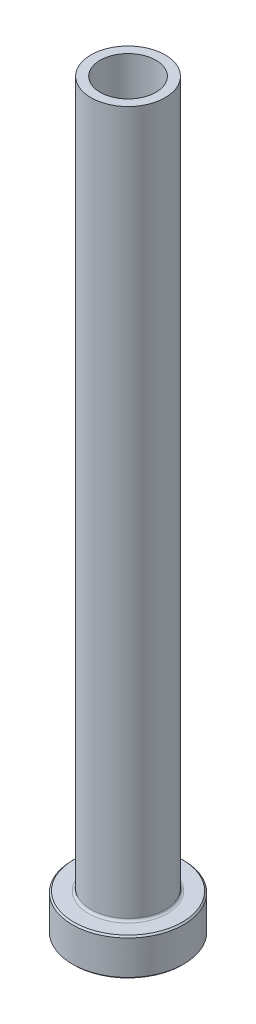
from build123d import *

# Parameters (mm, degrees)
CHAMFER1_SIZE = 0.254


with BuildPart() as part:
    # Sketch1 → Revolve1 (revolve)
    with BuildSketch(Plane.XY, mode=Mode.PRIVATE) as revolve1_sk:
        with BuildLine():
            Line((0, 0), (9.525, 0))
            Line((9.525, 0), (9.525, 6.35))
            Line((9.525, 6.35), (6.740525, 6.35))
            ThreePointArc((6.740525, 6.35), (6.459891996, 6.466241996), (6.34365, 6.746875))
            Line((6.34365, 6.746875), (6.34365, 127))
            Line((6.34365, 127), (0, 127))
            Line((0, 127), (0, 0))
        make_face()
    revolve(revolve1_sk.sketch.rotate(Axis((0, 0, 0), (0, 1, 0)), 90), axis=Axis((0, 0, 0), (0, 1, 0)))

    # Sketch2 → Cut-Revolve1 (revolve, cut)
    with BuildSketch(Plane.XY, mode=Mode.PRIVATE) as cut_revolve1_sk:
        Polygon((5.349875, 0), (4.953, 0.396875), (4.953, 52.5145), (4.7625, 66.802), (4.7625, 127), (0, 127), (0, 0), align=None)
    revolve(cut_revolve1_sk.sketch.rotate(Axis((0, 0, 0), (0, 1, 0)), 90), axis=Axis((0, 0, 0), (0, 1, 0)), mode=Mode.SUBTRACT)

    # Chamfer1
    chamfer1_edges = [part.edges().sort_by_distance(p)[0] for p in [
        (0, 6.35, 9.525),
        (0, 0, 9.525),
    ]]
    chamfer(chamfer1_edges, length=CHAMFER1_SIZE)


solid = part.part
